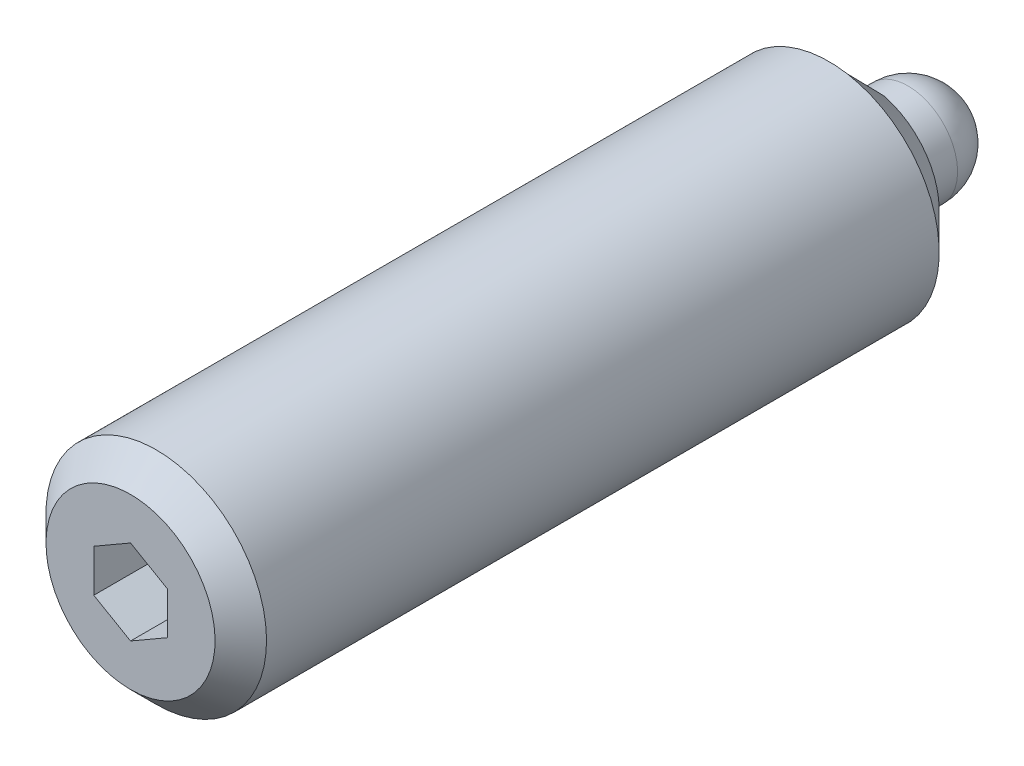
ISO-10303-21;
HEADER;
FILE_DESCRIPTION(('STEP AP214'),'2;1');
FILE_NAME('part.step','',(''),(''),'','','');
FILE_SCHEMA(('AUTOMOTIVE_DESIGN { 1 0 10303 214 1 1 1 1 }'));
ENDSEC;
DATA;
#1=APPLICATION_CONTEXT('core data for automotive mechanical design processes');
#2=APPLICATION_PROTOCOL_DEFINITION('international standard','automotive_design',2000,#1);
#3=PRODUCT_CONTEXT('',#1,'mechanical');
#4=PRODUCT('Part','Part','',(#3));
#5=PRODUCT_RELATED_PRODUCT_CATEGORY('part','',(#4));
#6=PRODUCT_DEFINITION_FORMATION('','',#4);
#7=PRODUCT_DEFINITION_CONTEXT('part definition',#1,'design');
#8=PRODUCT_DEFINITION('design','',#6,#7);
#9=PRODUCT_DEFINITION_SHAPE('','',#8);
#10=(LENGTH_UNIT() NAMED_UNIT(*) SI_UNIT(.MILLI.,.METRE.));
#11=(NAMED_UNIT(*) PLANE_ANGLE_UNIT() SI_UNIT($,.RADIAN.));
#12=(NAMED_UNIT(*) SI_UNIT($,.STERADIAN.) SOLID_ANGLE_UNIT());
#13=UNCERTAINTY_MEASURE_WITH_UNIT(LENGTH_MEASURE(1.E-05),#10,'distance_accuracy_value','');
#14=(GEOMETRIC_REPRESENTATION_CONTEXT(3) GLOBAL_UNCERTAINTY_ASSIGNED_CONTEXT((#13)) GLOBAL_UNIT_ASSIGNED_CONTEXT((#10,
#11,#12)) REPRESENTATION_CONTEXT('',''));
#15=CARTESIAN_POINT('',(0.,0.,0.));
#16=DIRECTION('',(0.,0.,1.));
#17=DIRECTION('',(1.,0.,0.));
#18=AXIS2_PLACEMENT_3D('',#15,#16,#17);
#19=CARTESIAN_POINT('',(0.,1.35,2.5));
#20=DIRECTION('',(0.,0.,-1.));
#21=DIRECTION('',(-1.,0.,0.));
#22=AXIS2_PLACEMENT_3D('',#19,#20,#21);
#23=PLANE('',#22);
#24=DIRECTION('',(0.,1.,0.));
#25=VECTOR('',#24,1.);
#26=CARTESIAN_POINT('',(-0.5,-1.25399362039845,2.5));
#27=LINE('',#26,#25);
#28=CARTESIAN_POINT('',(-0.5,-1.9364916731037,2.5));
#29=VERTEX_POINT('',#28);
#30=CARTESIAN_POINT('',(-0.5,-1.25399362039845,2.5));
#31=VERTEX_POINT('',#30);
#32=EDGE_CURVE('E136',#29,#31,#27,.T.);
#33=ORIENTED_EDGE('',*,*,#32,.F.);
#34=CARTESIAN_POINT('',(0.,0.,2.5));
#35=DIRECTION('',(0.,0.,-1.));
#36=DIRECTION('',(0.,1.,0.));
#37=AXIS2_PLACEMENT_3D('',#34,#35,#36);
#38=CIRCLE('',#37,2.);
#39=CARTESIAN_POINT('',(-0.5,1.9364916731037,2.5));
#40=VERTEX_POINT('',#39);
#41=EDGE_CURVE('E227',#29,#40,#38,.T.);
#42=ORIENTED_EDGE('',*,*,#41,.T.);
#43=DIRECTION('',(0.,1.,0.));
#44=VECTOR('',#43,1.);
#45=CARTESIAN_POINT('',(-0.5,3.47467274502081,2.5));
#46=LINE('',#45,#44);
#47=CARTESIAN_POINT('',(-0.5,1.25399362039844,2.5));
#48=VERTEX_POINT('',#47);
#49=EDGE_CURVE('E154',#48,#40,#46,.T.);
#50=ORIENTED_EDGE('',*,*,#49,.F.);
#51=CARTESIAN_POINT('',(0.,0.,2.5));
#52=DIRECTION('',(0.,0.,-1.));
#53=DIRECTION('',(-1.,0.,0.));
#54=AXIS2_PLACEMENT_3D('',#51,#52,#53);
#55=CIRCLE('',#54,1.35);
#56=EDGE_CURVE('E218',#31,#48,#55,.T.);
#57=ORIENTED_EDGE('',*,*,#56,.F.);
#58=EDGE_LOOP('',(#33,#42,#50,#57));
#59=FACE_BOUND('',#58,.T.);
#60=ADVANCED_FACE('F14',(#59),#23,.T.);
#61=CARTESIAN_POINT('',(0.,0.,2.5));
#62=DIRECTION('',(0.,0.,1.));
#63=DIRECTION('',(0.,-1.,0.));
#64=AXIS2_PLACEMENT_3D('',#61,#62,#63);
#65=CONICAL_SURFACE('',#64,2.,0.785398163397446);
#66=CARTESIAN_POINT('',(-0.5,-4.21027952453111,4.7398648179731));
#67=CARTESIAN_POINT('',(-0.5,-4.04912718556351,4.57985052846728));
#68=CARTESIAN_POINT('',(-0.500000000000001,-3.88792343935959,4.41988777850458));
#69=CARTESIAN_POINT('',(-0.500000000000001,-3.56534038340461,4.10016153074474));
#70=CARTESIAN_POINT('',(-0.5,-3.4039610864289,3.94039802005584));
#71=CARTESIAN_POINT('',(-0.5,-3.08097988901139,3.62119168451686));
#72=CARTESIAN_POINT('',(-0.5,-2.91937806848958,3.46174877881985));
#73=CARTESIAN_POINT('',(-0.5,-2.5957327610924,3.14328890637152));
#74=CARTESIAN_POINT('',(-0.5,-2.43368924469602,2.98427196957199));
#75=CARTESIAN_POINT('',(-0.5,-2.20373868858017,2.75970346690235));
#76=CARTESIAN_POINT('',(-0.5,-2.13614845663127,2.69382760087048));
#77=CARTESIAN_POINT('',(-0.5,-2.00079166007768,2.56225904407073));
#78=CARTESIAN_POINT('',(-0.5,-1.93302509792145,2.49656635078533));
#79=CARTESIAN_POINT('',(-0.5,-1.79726638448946,2.36543760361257));
#80=CARTESIAN_POINT('',(-0.5,-1.72927427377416,2.30000150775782));
#81=CARTESIAN_POINT('',(-0.5,-1.59295780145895,2.16946905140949));
#82=CARTESIAN_POINT('',(-0.5,-1.52463342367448,2.10437270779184));
#83=CARTESIAN_POINT('',(-0.5,-1.38747092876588,1.97464527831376));
#84=CARTESIAN_POINT('',(-0.5,-1.3186325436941,1.91001447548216));
#85=CARTESIAN_POINT('',(-0.5,-1.18024864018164,1.78152916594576));
#86=CARTESIAN_POINT('',(-0.5,-1.11070321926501,1.71767455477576));
#87=CARTESIAN_POINT('',(-0.5,-1.00548564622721,1.62284194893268));
#88=CARTESIAN_POINT('',(-0.5,-0.970251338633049,1.59137898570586));
#89=CARTESIAN_POINT('',(-0.5,-0.899394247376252,1.52889802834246));
#90=CARTESIAN_POINT('',(-0.5,-0.863771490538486,1.4978800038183));
#91=CARTESIAN_POINT('',(-0.5,-0.791991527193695,1.43642895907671));
#92=CARTESIAN_POINT('',(-0.5,-0.755834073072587,1.40599622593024));
#93=CARTESIAN_POINT('',(-0.5,-0.682771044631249,1.34602680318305));
#94=CARTESIAN_POINT('',(-0.5,-0.645865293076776,1.31649033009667));
#95=CARTESIAN_POINT('',(-0.5,-0.608478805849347,1.28755727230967));
#96=B_SPLINE_CURVE_WITH_KNOTS('',3,(#66,#67,#68,#69,#70,#71,#72,#73,#74,#75,#76,#77,#78,#79,#80,
#81,#82,#83,#84,#85,#86,#87,#88,#89,#90,#91,#92,#93,#94,#95),.UNSPECIFIED.,.F.,.F.,(4,2,2,2,2,2,
2,2,2,2,2,2,2,2,4),(0.,0.681301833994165,1.36255702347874,2.04361079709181,2.72471126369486,
3.00785872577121,3.29100227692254,3.57409740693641,3.85720646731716,4.14047515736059,
4.42370529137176,4.56541471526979,4.70711441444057,4.84888192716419,4.99068341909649),.UNSPECIFIED.);
#97=CARTESIAN_POINT('',(-0.5,-2.9580398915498,3.5));
#98=VERTEX_POINT('',#97);
#99=EDGE_CURVE('E9',#98,#29,#96,.T.);
#100=ORIENTED_EDGE('',*,*,#99,.F.);
#101=CARTESIAN_POINT('',(0.,0.,3.5));
#102=DIRECTION('',(0.,0.,-1.));
#103=DIRECTION('',(0.,1.,0.));
#104=AXIS2_PLACEMENT_3D('',#101,#102,#103);
#105=CIRCLE('',#104,3.);
#106=CARTESIAN_POINT('',(-0.5,2.9580398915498,3.5));
#107=VERTEX_POINT('',#106);
#108=EDGE_CURVE('E232',#107,#98,#105,.F.);
#109=ORIENTED_EDGE('',*,*,#108,.F.);
#110=CARTESIAN_POINT('',(-0.5,0.794414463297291,1.43866625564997));
#111=CARTESIAN_POINT('',(-0.5,0.829426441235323,1.46831353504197));
#112=CARTESIAN_POINT('',(-0.5,0.864178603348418,1.49826325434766));
#113=CARTESIAN_POINT('',(-0.5,0.933269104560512,1.5586320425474));
#114=CARTESIAN_POINT('',(-0.5,0.967607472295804,1.58905107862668));
#115=CARTESIAN_POINT('',(-0.5,1.07015688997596,1.68080538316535));
#116=CARTESIAN_POINT('',(-0.5,1.13791337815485,1.74264741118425));
#117=CARTESIAN_POINT('',(-0.5,1.27266367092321,1.86711918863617));
#118=CARTESIAN_POINT('',(-0.5,1.33965766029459,1.92974873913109));
#119=CARTESIAN_POINT('',(-0.5,1.47315463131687,2.05553399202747));
#120=CARTESIAN_POINT('',(-0.5,1.53965759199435,2.11868971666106));
#121=CARTESIAN_POINT('',(-0.5,1.6798220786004,2.2525184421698));
#122=CARTESIAN_POINT('',(-0.5,1.75344286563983,2.32323404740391));
#123=CARTESIAN_POINT('',(-0.5,1.9003952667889,2.46497569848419));
#124=CARTESIAN_POINT('',(-0.5,1.97372685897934,2.53600176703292));
#125=CARTESIAN_POINT('',(-0.5,2.19454222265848,2.75050496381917));
#126=CARTESIAN_POINT('',(-0.5,2.34170559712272,2.89431173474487));
#127=CARTESIAN_POINT('',(-0.5,2.63555520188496,3.18241211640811));
#128=CARTESIAN_POINT('',(-0.5,2.78224143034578,3.32670572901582));
#129=CARTESIAN_POINT('',(-0.5,3.07526769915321,3.61555084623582));
#130=CARTESIAN_POINT('',(-0.5,3.22160783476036,3.76010225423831));
#131=CARTESIAN_POINT('',(-0.5,3.51407993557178,4.04941239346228));
#132=CARTESIAN_POINT('',(-0.5,3.66021190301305,4.19417112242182));
#133=CARTESIAN_POINT('',(-0.5,3.80628698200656,4.33898692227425));
#134=B_SPLINE_CURVE_WITH_KNOTS('',3,(#110,#111,#112,#113,#114,#115,#116,#117,#118,#119,#120,
#121,#122,#123,#124,#125,#126,#127,#128,#129,#130,#131,#132,#133),.UNSPECIFIED.,.F.,.F.,(4,2,2,
2,2,2,2,2,2,2,2,4),(0.,0.137628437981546,0.275247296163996,0.550441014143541,0.825566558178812,
1.100703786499,1.40694830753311,1.71321561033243,2.3304950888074,2.94777694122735,
3.5648624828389,4.18194134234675),.UNSPECIFIED.);
#135=EDGE_CURVE('E235',#40,#107,#134,.T.);
#136=ORIENTED_EDGE('',*,*,#135,.F.);
#137=ORIENTED_EDGE('',*,*,#41,.F.);
#138=EDGE_LOOP('',(#100,#109,#136,#137));
#139=FACE_BOUND('',#138,.T.);
#140=ADVANCED_FACE('F303',(#139),#65,.T.);
#141=CARTESIAN_POINT('',(0.,3.,22.5));
#142=DIRECTION('',(0.,0.,1.));
#143=DIRECTION('',(1.,0.,0.));
#144=AXIS2_PLACEMENT_3D('',#141,#142,#143);
#145=PLANE('',#144);
#146=CARTESIAN_POINT('',(0.,0.,22.5));
#147=DIRECTION('',(0.,0.,1.));
#148=DIRECTION('',(0.,-1.,0.));
#149=AXIS2_PLACEMENT_3D('',#146,#147,#148);
#150=CIRCLE('',#149,2.3);
#151=CARTESIAN_POINT('',(0.,-2.30000000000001,22.5));
#152=VERTEX_POINT('',#151);
#153=EDGE_CURVE('E224',#152,#152,#150,.T.);
#154=ORIENTED_EDGE('',*,*,#153,.T.);
#155=EDGE_LOOP('',(#154));
#156=FACE_BOUND('',#155,.T.);
#157=DIRECTION('',(0.866025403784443,-0.499999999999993,0.));
#158=VECTOR('',#157,1.);
#159=CARTESIAN_POINT('',(-1.,-0.577350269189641,22.5));
#160=LINE('',#159,#158);
#161=CARTESIAN_POINT('',(-1.,-0.57735026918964,22.5));
#162=VERTEX_POINT('',#161);
#163=CARTESIAN_POINT('',(0.,-1.15470053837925,22.5));
#164=VERTEX_POINT('',#163);
#165=EDGE_CURVE('E181',#162,#164,#160,.T.);
#166=ORIENTED_EDGE('',*,*,#165,.F.);
#167=DIRECTION('',(0.,1.,0.));
#168=VECTOR('',#167,1.);
#169=CARTESIAN_POINT('',(-1.,-0.577350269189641,22.5));
#170=LINE('',#169,#168);
#171=CARTESIAN_POINT('',(-1.,0.577350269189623,22.5));
#172=VERTEX_POINT('',#171);
#173=EDGE_CURVE('E164',#162,#172,#170,.T.);
#174=ORIENTED_EDGE('',*,*,#173,.T.);
#175=DIRECTION('',(0.866025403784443,0.499999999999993,0.));
#176=VECTOR('',#175,1.);
#177=CARTESIAN_POINT('',(-1.,0.577350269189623,22.5));
#178=LINE('',#177,#176);
#179=CARTESIAN_POINT('',(0.,1.15470053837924,22.5));
#180=VERTEX_POINT('',#179);
#181=EDGE_CURVE('E169',#172,#180,#178,.T.);
#182=ORIENTED_EDGE('',*,*,#181,.T.);
#183=DIRECTION('',(-0.866025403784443,0.499999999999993,0.));
#184=VECTOR('',#183,1.);
#185=CARTESIAN_POINT('',(1.,0.577350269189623,22.5));
#186=LINE('',#185,#184);
#187=CARTESIAN_POINT('',(1.,0.577350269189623,22.5));
#188=VERTEX_POINT('',#187);
#189=EDGE_CURVE('E172',#188,#180,#186,.T.);
#190=ORIENTED_EDGE('',*,*,#189,.F.);
#191=DIRECTION('',(0.,1.,0.));
#192=VECTOR('',#191,1.);
#193=CARTESIAN_POINT('',(1.,-0.577350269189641,22.5));
#194=LINE('',#193,#192);
#195=CARTESIAN_POINT('',(1.,-0.577350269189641,22.5));
#196=VERTEX_POINT('',#195);
#197=EDGE_CURVE('E175',#196,#188,#194,.T.);
#198=ORIENTED_EDGE('',*,*,#197,.F.);
#199=DIRECTION('',(-0.866025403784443,-0.499999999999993,0.));
#200=VECTOR('',#199,1.);
#201=CARTESIAN_POINT('',(1.,-0.577350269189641,22.5));
#202=LINE('',#201,#200);
#203=EDGE_CURVE('E178',#196,#164,#202,.T.);
#204=ORIENTED_EDGE('',*,*,#203,.T.);
#205=EDGE_LOOP('',(#166,#174,#182,#190,#198,#204));
#206=FACE_BOUND('',#205,.T.);
#207=ADVANCED_FACE('F300',(#156,#206),#145,.T.);
#208=CARTESIAN_POINT('',(0.,0.,1.35));
#209=DIRECTION('',(-1.,0.,0.));
#210=DIRECTION('',(0.,0.,1.));
#211=AXIS2_PLACEMENT_3D('',#208,#209,#210);
#212=SPHERICAL_SURFACE('',#211,1.35);
#213=CARTESIAN_POINT('',(0.,0.,1.35));
#214=DIRECTION('',(0.,0.,-1.));
#215=DIRECTION('',(-1.,0.,0.));
#216=AXIS2_PLACEMENT_3D('',#213,#214,#215);
#217=SPHERICAL_SURFACE('',#216,1.35);
#218=CARTESIAN_POINT('',(0.,0.,1.35));
#219=DIRECTION('',(0.,0.,-1.));
#220=DIRECTION('',(-1.,0.,0.));
#221=AXIS2_PLACEMENT_3D('',#218,#219,#220);
#222=CIRCLE('',#221,1.35);
#223=CARTESIAN_POINT('',(-1.35,0.,1.35));
#224=VERTEX_POINT('',#223);
#225=EDGE_CURVE('E215',#224,#224,#222,.T.);
#226=ORIENTED_EDGE('',*,*,#225,.T.);
#227=EDGE_LOOP('',(#226));
#228=FACE_BOUND('',#227,.T.);
#229=ADVANCED_FACE('F298',(#228),#217,.T.);
#230=CARTESIAN_POINT('',(0.,0.,-3.5));
#231=DIRECTION('',(0.,0.,-1.));
#232=DIRECTION('',(-1.,0.,0.));
#233=AXIS2_PLACEMENT_3D('',#230,#231,#232);
#234=CYLINDRICAL_SURFACE('',#233,3.);
#235=ORIENTED_EDGE('',*,*,#108,.T.);
#236=CARTESIAN_POINT('',(0.5,-2.95803989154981,3.5));
#237=VERTEX_POINT('',#236);
#238=EDGE_CURVE('E127',#98,#237,#105,.F.);
#239=ORIENTED_EDGE('',*,*,#238,.T.);
#240=CARTESIAN_POINT('',(0.5,2.95803989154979,3.5));
#241=VERTEX_POINT('',#240);
#242=EDGE_CURVE('E236',#237,#241,#105,.F.);
#243=ORIENTED_EDGE('',*,*,#242,.T.);
#244=EDGE_CURVE('E231',#241,#107,#105,.F.);
#245=ORIENTED_EDGE('',*,*,#244,.T.);
#246=EDGE_LOOP('',(#235,#239,#243,#245));
#247=FACE_BOUND('',#246,.T.);
#248=CARTESIAN_POINT('',(0.,0.,21.8));
#249=DIRECTION('',(0.,0.,1.));
#250=DIRECTION('',(0.,-1.,0.));
#251=AXIS2_PLACEMENT_3D('',#248,#249,#250);
#252=CIRCLE('',#251,3.);
#253=CARTESIAN_POINT('',(0.,-3.00000000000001,21.8));
#254=VERTEX_POINT('',#253);
#255=EDGE_CURVE('E221',#254,#254,#252,.F.);
#256=ORIENTED_EDGE('',*,*,#255,.T.);
#257=EDGE_LOOP('',(#256));
#258=FACE_BOUND('',#257,.T.);
#259=ADVANCED_FACE('F294',(#247,#258),#234,.T.);
#260=DIRECTION('',(0.,-1.,0.));
#261=VECTOR('',#260,1.);
#262=CARTESIAN_POINT('',(0.5,-1.25399362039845,2.5));
#263=LINE('',#262,#261);
#264=CARTESIAN_POINT('',(0.5,-1.25399362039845,2.5));
#265=VERTEX_POINT('',#264);
#266=CARTESIAN_POINT('',(0.5,-1.9364916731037,2.5));
#267=VERTEX_POINT('',#266);
#268=EDGE_CURVE('E130',#265,#267,#263,.T.);
#269=ORIENTED_EDGE('',*,*,#268,.F.);
#270=CARTESIAN_POINT('',(0.5,1.25399362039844,2.5));
#271=VERTEX_POINT('',#270);
#272=EDGE_CURVE('E219',#271,#265,#55,.T.);
#273=ORIENTED_EDGE('',*,*,#272,.F.);
#274=DIRECTION('',(0.,-1.,0.));
#275=VECTOR('',#274,1.);
#276=CARTESIAN_POINT('',(0.5,3.47467274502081,2.5));
#277=LINE('',#276,#275);
#278=CARTESIAN_POINT('',(0.5,1.9364916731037,2.5));
#279=VERTEX_POINT('',#278);
#280=EDGE_CURVE('E149',#279,#271,#277,.T.);
#281=ORIENTED_EDGE('',*,*,#280,.F.);
#282=EDGE_CURVE('E228',#279,#267,#38,.T.);
#283=ORIENTED_EDGE('',*,*,#282,.T.);
#284=EDGE_LOOP('',(#269,#273,#281,#283));
#285=FACE_BOUND('',#284,.T.);
#286=ADVANCED_FACE('F291',(#285),#23,.T.);
#287=CARTESIAN_POINT('',(0.,0.,-3.5));
#288=DIRECTION('',(0.,0.,-1.));
#289=DIRECTION('',(-1.,0.,0.));
#290=AXIS2_PLACEMENT_3D('',#287,#288,#289);
#291=CYLINDRICAL_SURFACE('',#290,1.35);
#292=ORIENTED_EDGE('',*,*,#272,.T.);
#293=DIRECTION('',(0.,0.,-1.));
#294=VECTOR('',#293,1.);
#295=CARTESIAN_POINT('',(0.5,-1.25399362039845,3.5));
#296=LINE('',#295,#294);
#297=CARTESIAN_POINT('',(0.5,-1.25399362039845,3.5));
#298=VERTEX_POINT('',#297);
#299=EDGE_CURVE('E139',#298,#265,#296,.T.);
#300=ORIENTED_EDGE('',*,*,#299,.F.);
#301=CARTESIAN_POINT('',(0.,0.,3.5));
#302=DIRECTION('',(0.,0.,1.));
#303=DIRECTION('',(0.,1.,0.));
#304=AXIS2_PLACEMENT_3D('',#301,#302,#303);
#305=CIRCLE('',#304,1.35);
#306=CARTESIAN_POINT('',(-0.5,-1.25399362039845,3.5));
#307=VERTEX_POINT('',#306);
#308=EDGE_CURVE('E125',#307,#298,#305,.T.);
#309=ORIENTED_EDGE('',*,*,#308,.F.);
#310=DIRECTION('',(0.,0.,-1.));
#311=VECTOR('',#310,1.);
#312=CARTESIAN_POINT('',(-0.5,-1.25399362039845,3.5));
#313=LINE('',#312,#311);
#314=EDGE_CURVE('E133',#307,#31,#313,.T.);
#315=ORIENTED_EDGE('',*,*,#314,.T.);
#316=ORIENTED_EDGE('',*,*,#56,.T.);
#317=DIRECTION('',(0.,0.,-1.));
#318=VECTOR('',#317,1.);
#319=CARTESIAN_POINT('',(-0.5,1.25399362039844,3.5));
#320=LINE('',#319,#318);
#321=CARTESIAN_POINT('',(-0.5,1.25399362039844,3.5));
#322=VERTEX_POINT('',#321);
#323=EDGE_CURVE('E161',#322,#48,#320,.T.);
#324=ORIENTED_EDGE('',*,*,#323,.F.);
#325=CARTESIAN_POINT('',(0.,0.,3.5));
#326=DIRECTION('',(0.,0.,1.));
#327=DIRECTION('',(0.,1.,0.));
#328=AXIS2_PLACEMENT_3D('',#325,#326,#327);
#329=CIRCLE('',#328,1.35);
#330=CARTESIAN_POINT('',(0.5,1.25399362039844,3.5));
#331=VERTEX_POINT('',#330);
#332=EDGE_CURVE('E153',#331,#322,#329,.T.);
#333=ORIENTED_EDGE('',*,*,#332,.F.);
#334=DIRECTION('',(0.,0.,-1.));
#335=VECTOR('',#334,1.);
#336=CARTESIAN_POINT('',(0.5,1.25399362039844,3.5));
#337=LINE('',#336,#335);
#338=EDGE_CURVE('E157',#331,#271,#337,.T.);
#339=ORIENTED_EDGE('',*,*,#338,.T.);
#340=EDGE_LOOP('',(#292,#300,#309,#315,#316,#324,#333,#339));
#341=FACE_BOUND('',#340,.T.);
#342=ORIENTED_EDGE('',*,*,#225,.F.);
#343=EDGE_LOOP('',(#342));
#344=FACE_BOUND('',#343,.T.);
#345=ADVANCED_FACE('F142',(#341,#344),#291,.T.);
#346=CARTESIAN_POINT('',(-1.,-0.57735026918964,20.));
#347=DIRECTION('',(1.,0.,0.));
#348=DIRECTION('',(0.,0.,-1.));
#349=AXIS2_PLACEMENT_3D('',#346,#347,#348);
#350=PLANE('',#349);
#351=DIRECTION('',(0.,0.,1.));
#352=VECTOR('',#351,1.);
#353=CARTESIAN_POINT('',(-1.,0.577350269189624,20.));
#354=LINE('',#353,#352);
#355=CARTESIAN_POINT('',(-1.,0.577350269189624,20.));
#356=VERTEX_POINT('',#355);
#357=EDGE_CURVE('E213',#356,#172,#354,.T.);
#358=ORIENTED_EDGE('',*,*,#357,.T.);
#359=ORIENTED_EDGE('',*,*,#173,.F.);
#360=DIRECTION('',(0.,0.,1.));
#361=VECTOR('',#360,1.);
#362=CARTESIAN_POINT('',(-1.,-0.57735026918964,20.));
#363=LINE('',#362,#361);
#364=CARTESIAN_POINT('',(-1.,-0.57735026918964,20.));
#365=VERTEX_POINT('',#364);
#366=EDGE_CURVE('E202',#365,#162,#363,.T.);
#367=ORIENTED_EDGE('',*,*,#366,.F.);
#368=DIRECTION('',(0.,1.,0.));
#369=VECTOR('',#368,1.);
#370=CARTESIAN_POINT('',(-1.,-0.57735026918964,20.));
#371=LINE('',#370,#369);
#372=EDGE_CURVE('E184',#365,#356,#371,.T.);
#373=ORIENTED_EDGE('',*,*,#372,.T.);
#374=EDGE_LOOP('',(#358,#359,#367,#373));
#375=FACE_BOUND('',#374,.T.);
#376=ADVANCED_FACE('F267',(#375),#350,.T.);
#377=CARTESIAN_POINT('',(-1.,0.577350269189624,20.));
#378=DIRECTION('',(0.499999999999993,-0.866025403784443,0.));
#379=DIRECTION('',(0.866025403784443,0.499999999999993,0.));
#380=AXIS2_PLACEMENT_3D('',#377,#378,#379);
#381=PLANE('',#380);
#382=DIRECTION('',(0.,0.,1.));
#383=VECTOR('',#382,1.);
#384=CARTESIAN_POINT('',(0.,1.15470053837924,20.));
#385=LINE('',#384,#383);
#386=CARTESIAN_POINT('',(0.,1.15470053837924,20.));
#387=VERTEX_POINT('',#386);
#388=EDGE_CURVE('E211',#387,#180,#385,.T.);
#389=ORIENTED_EDGE('',*,*,#388,.T.);
#390=ORIENTED_EDGE('',*,*,#181,.F.);
#391=ORIENTED_EDGE('',*,*,#357,.F.);
#392=DIRECTION('',(0.866025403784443,0.499999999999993,0.));
#393=VECTOR('',#392,1.);
#394=CARTESIAN_POINT('',(-1.,0.577350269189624,20.));
#395=LINE('',#394,#393);
#396=EDGE_CURVE('E187',#356,#387,#395,.T.);
#397=ORIENTED_EDGE('',*,*,#396,.T.);
#398=EDGE_LOOP('',(#389,#390,#391,#397));
#399=FACE_BOUND('',#398,.T.);
#400=ADVANCED_FACE('F270',(#399),#381,.T.);
#401=CARTESIAN_POINT('',(1.,0.577350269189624,20.));
#402=DIRECTION('',(0.499999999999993,0.866025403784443,0.));
#403=DIRECTION('',(-0.866025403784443,0.499999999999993,0.));
#404=AXIS2_PLACEMENT_3D('',#401,#402,#403);
#405=PLANE('',#404);
#406=DIRECTION('',(0.,0.,1.));
#407=VECTOR('',#406,1.);
#408=CARTESIAN_POINT('',(1.,0.577350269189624,20.));
#409=LINE('',#408,#407);
#410=CARTESIAN_POINT('',(1.,0.577350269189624,20.));
#411=VERTEX_POINT('',#410);
#412=EDGE_CURVE('E209',#411,#188,#409,.T.);
#413=ORIENTED_EDGE('',*,*,#412,.T.);
#414=ORIENTED_EDGE('',*,*,#189,.T.);
#415=ORIENTED_EDGE('',*,*,#388,.F.);
#416=DIRECTION('',(-0.866025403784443,0.499999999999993,0.));
#417=VECTOR('',#416,1.);
#418=CARTESIAN_POINT('',(1.,0.577350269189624,20.));
#419=LINE('',#418,#417);
#420=EDGE_CURVE('E190',#411,#387,#419,.T.);
#421=ORIENTED_EDGE('',*,*,#420,.F.);
#422=EDGE_LOOP('',(#413,#414,#415,#421));
#423=FACE_BOUND('',#422,.T.);
#424=ADVANCED_FACE('F281',(#423),#405,.F.);
#425=CARTESIAN_POINT('',(1.,-0.57735026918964,20.));
#426=DIRECTION('',(1.,0.,0.));
#427=DIRECTION('',(0.,0.,-1.));
#428=AXIS2_PLACEMENT_3D('',#425,#426,#427);
#429=PLANE('',#428);
#430=DIRECTION('',(0.,0.,1.));
#431=VECTOR('',#430,1.);
#432=CARTESIAN_POINT('',(1.,-0.57735026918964,20.));
#433=LINE('',#432,#431);
#434=CARTESIAN_POINT('',(1.,-0.57735026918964,20.));
#435=VERTEX_POINT('',#434);
#436=EDGE_CURVE('E207',#435,#196,#433,.T.);
#437=ORIENTED_EDGE('',*,*,#436,.T.);
#438=ORIENTED_EDGE('',*,*,#197,.T.);
#439=ORIENTED_EDGE('',*,*,#412,.F.);
#440=DIRECTION('',(0.,1.,0.));
#441=VECTOR('',#440,1.);
#442=CARTESIAN_POINT('',(1.,-0.57735026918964,20.));
#443=LINE('',#442,#441);
#444=EDGE_CURVE('E193',#435,#411,#443,.T.);
#445=ORIENTED_EDGE('',*,*,#444,.F.);
#446=EDGE_LOOP('',(#437,#438,#439,#445));
#447=FACE_BOUND('',#446,.T.);
#448=ADVANCED_FACE('F277',(#447),#429,.F.);
#449=CARTESIAN_POINT('',(1.,-0.57735026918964,20.));
#450=DIRECTION('',(-0.499999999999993,0.866025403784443,0.));
#451=DIRECTION('',(-0.866025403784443,-0.499999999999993,0.));
#452=AXIS2_PLACEMENT_3D('',#449,#450,#451);
#453=PLANE('',#452);
#454=DIRECTION('',(0.,0.,1.));
#455=VECTOR('',#454,1.);
#456=CARTESIAN_POINT('',(0.,-1.15470053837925,20.));
#457=LINE('',#456,#455);
#458=CARTESIAN_POINT('',(0.,-1.15470053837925,20.));
#459=VERTEX_POINT('',#458);
#460=EDGE_CURVE('E205',#459,#164,#457,.T.);
#461=ORIENTED_EDGE('',*,*,#460,.T.);
#462=ORIENTED_EDGE('',*,*,#203,.F.);
#463=ORIENTED_EDGE('',*,*,#436,.F.);
#464=DIRECTION('',(-0.866025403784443,-0.499999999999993,0.));
#465=VECTOR('',#464,1.);
#466=CARTESIAN_POINT('',(1.,-0.57735026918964,20.));
#467=LINE('',#466,#465);
#468=EDGE_CURVE('E196',#435,#459,#467,.T.);
#469=ORIENTED_EDGE('',*,*,#468,.T.);
#470=EDGE_LOOP('',(#461,#462,#463,#469));
#471=FACE_BOUND('',#470,.T.);
#472=ADVANCED_FACE('F266',(#471),#453,.T.);
#473=CARTESIAN_POINT('',(-1.,-0.57735026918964,20.));
#474=DIRECTION('',(-0.499999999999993,-0.866025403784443,0.));
#475=DIRECTION('',(0.866025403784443,-0.499999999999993,0.));
#476=AXIS2_PLACEMENT_3D('',#473,#474,#475);
#477=PLANE('',#476);
#478=DIRECTION('',(0.866025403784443,-0.499999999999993,0.));
#479=VECTOR('',#478,1.);
#480=CARTESIAN_POINT('',(-1.,-0.57735026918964,20.));
#481=LINE('',#480,#479);
#482=EDGE_CURVE('E199',#365,#459,#481,.T.);
#483=ORIENTED_EDGE('',*,*,#482,.F.);
#484=ORIENTED_EDGE('',*,*,#366,.T.);
#485=ORIENTED_EDGE('',*,*,#165,.T.);
#486=ORIENTED_EDGE('',*,*,#460,.F.);
#487=EDGE_LOOP('',(#483,#484,#485,#486));
#488=FACE_BOUND('',#487,.T.);
#489=ADVANCED_FACE('F264',(#488),#477,.F.);
#490=CARTESIAN_POINT('',(-1.,0.577350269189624,20.));
#491=DIRECTION('',(0.,0.,-1.));
#492=DIRECTION('',(-1.,0.,0.));
#493=AXIS2_PLACEMENT_3D('',#490,#491,#492);
#494=PLANE('',#493);
#495=ORIENTED_EDGE('',*,*,#372,.F.);
#496=ORIENTED_EDGE('',*,*,#482,.T.);
#497=ORIENTED_EDGE('',*,*,#468,.F.);
#498=ORIENTED_EDGE('',*,*,#444,.T.);
#499=ORIENTED_EDGE('',*,*,#420,.T.);
#500=ORIENTED_EDGE('',*,*,#396,.F.);
#501=EDGE_LOOP('',(#495,#496,#497,#498,#499,#500));
#502=FACE_BOUND('',#501,.T.);
#503=ADVANCED_FACE('F260',(#502),#494,.F.);
#504=CARTESIAN_POINT('',(0.,0.,21.8));
#505=DIRECTION('',(0.,0.,-1.));
#506=DIRECTION('',(0.,1.,0.));
#507=AXIS2_PLACEMENT_3D('',#504,#505,#506);
#508=CONICAL_SURFACE('',#507,3.,0.78539816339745);
#509=ORIENTED_EDGE('',*,*,#153,.F.);
#510=EDGE_LOOP('',(#509));
#511=FACE_BOUND('',#510,.T.);
#512=ORIENTED_EDGE('',*,*,#255,.F.);
#513=EDGE_LOOP('',(#512));
#514=FACE_BOUND('',#513,.T.);
#515=ADVANCED_FACE('F263',(#511,#514),#508,.T.);
#516=CARTESIAN_POINT('',(0.5,-0.608478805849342,1.28755727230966));
#517=CARTESIAN_POINT('',(0.5,-0.638982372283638,1.31114809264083));
#518=CARTESIAN_POINT('',(0.5,-0.669158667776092,1.33515279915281));
#519=CARTESIAN_POINT('',(0.5,-0.728984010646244,1.3838012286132));
#520=CARTESIAN_POINT('',(0.5,-0.758633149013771,1.40844483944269));
#521=CARTESIAN_POINT('',(0.5,-0.817529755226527,1.45818032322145));
#522=CARTESIAN_POINT('',(0.5,-0.846777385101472,1.48327200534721));
#523=CARTESIAN_POINT('',(0.5,-0.904968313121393,1.53380830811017));
#524=CARTESIAN_POINT('',(0.5,-0.933911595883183,1.55925294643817));
#525=CARTESIAN_POINT('',(0.5,-1.02034660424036,1.63595639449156));
#526=CARTESIAN_POINT('',(0.5,-1.07748131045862,1.68761706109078));
#527=CARTESIAN_POINT('',(0.5,-1.19113581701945,1.79162146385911));
#528=CARTESIAN_POINT('',(0.5,-1.24765553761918,1.84396528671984));
#529=CARTESIAN_POINT('',(0.5,-1.38564375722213,1.9728020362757));
#530=CARTESIAN_POINT('',(0.5,-1.4668766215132,2.04954707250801));
#531=CARTESIAN_POINT('',(0.5,-1.62877991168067,2.20361898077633));
#532=CARTESIAN_POINT('',(0.5,-1.70945036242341,2.28094582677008));
#533=CARTESIAN_POINT('',(0.5,-1.950986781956,2.51356274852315));
#534=CARTESIAN_POINT('',(0.5,-2.11130534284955,2.66942071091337));
#535=CARTESIAN_POINT('',(0.5,-2.43378431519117,2.98437785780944));
#536=CARTESIAN_POINT('',(0.5,-2.59593305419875,3.14348894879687));
#537=CARTESIAN_POINT('',(0.5,-2.9197935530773,3.46215463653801));
#538=CARTESIAN_POINT('',(0.5,-3.08150531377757,3.62170923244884));
#539=CARTESIAN_POINT('',(0.5,-3.40449596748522,3.94092839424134));
#540=CARTESIAN_POINT('',(0.5,-3.56577513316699,4.10059268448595));
#541=CARTESIAN_POINT('',(0.5,-3.88814672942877,4.42010882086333));
#542=CARTESIAN_POINT('',(0.5,-4.04923916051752,4.57996066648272));
#543=CARTESIAN_POINT('',(0.5,-4.21027952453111,4.7398648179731));
#544=B_SPLINE_CURVE_WITH_KNOTS('',3,(#516,#517,#518,#519,#520,#521,#522,#523,#524,#525,#526,
#527,#528,#529,#530,#531,#532,#533,#534,#535,#536,#537,#538,#539,#540,#541,#542,#543),
.UNSPECIFIED.,.F.,.F.,(4,2,2,2,2,2,2,2,2,2,2,2,2,4),(0.,0.115672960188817,0.231325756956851,
0.346930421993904,0.46254090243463,0.693612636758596,0.924713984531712,1.25996533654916,
1.59520177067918,2.26597379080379,2.94749863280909,3.62902218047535,4.30985454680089,
4.99068505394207),.UNSPECIFIED.);
#545=EDGE_CURVE('E28',#267,#237,#544,.T.);
#546=ORIENTED_EDGE('',*,*,#545,.F.);
#547=ORIENTED_EDGE('',*,*,#282,.F.);
#548=CARTESIAN_POINT('',(0.5,3.80628698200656,4.33898692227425));
#549=CARTESIAN_POINT('',(0.5,3.66017177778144,4.19413132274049));
#550=CARTESIAN_POINT('',(0.5,3.51399963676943,4.04933284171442));
#551=CARTESIAN_POINT('',(0.5,3.22144830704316,3.75994457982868));
#552=CARTESIAN_POINT('',(0.5,3.07506911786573,3.61535479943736));
#553=CARTESIAN_POINT('',(0.5,2.78204568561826,3.32651307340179));
#554=CARTESIAN_POINT('',(0.5,2.63540151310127,3.18226105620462));
#555=CARTESIAN_POINT('',(0.5,2.34163097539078,2.89423895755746));
#556=CARTESIAN_POINT('',(0.5,2.19450459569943,2.75046889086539));
#557=CARTESIAN_POINT('',(0.5,1.94456304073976,2.50767128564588));
#558=CARTESIAN_POINT('',(0.5,1.84196789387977,2.40841735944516));
#559=CARTESIAN_POINT('',(0.499999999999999,1.63613587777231,2.21058883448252));
#560=CARTESIAN_POINT('',(0.499999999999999,1.53289905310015,2.11201418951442));
#561=CARTESIAN_POINT('',(0.499999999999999,1.37718050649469,1.96503885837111));
#562=CARTESIAN_POINT('',(0.499999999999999,1.32512364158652,1.91618858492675));
#563=CARTESIAN_POINT('',(0.499999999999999,1.22061594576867,1.81891471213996));
#564=CARTESIAN_POINT('',(0.499999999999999,1.16816512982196,1.77049109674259));
#565=CARTESIAN_POINT('',(0.499999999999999,1.0626920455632,1.67424278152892));
#566=CARTESIAN_POINT('',(0.499999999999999,1.00966964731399,1.6264182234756));
#567=CARTESIAN_POINT('',(0.499999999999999,0.929507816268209,1.55538250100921));
#568=CARTESIAN_POINT('',(0.499999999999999,0.902680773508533,1.53181930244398));
#569=CARTESIAN_POINT('',(0.499999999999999,0.848760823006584,1.4849969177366));
#570=CARTESIAN_POINT('',(0.5,0.821667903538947,1.46173774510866));
#571=CARTESIAN_POINT('',(0.5,0.79441446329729,1.43866625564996));
#572=B_SPLINE_CURVE_WITH_KNOTS('',3,(#548,#549,#550,#551,#552,#553,#554,#555,#556,#557,#558,
#559,#560,#561,#562,#563,#564,#565,#566,#567,#568,#569,#570,#571),.UNSPECIFIED.,.F.,.F.,(4,2,2,
2,2,2,2,2,2,2,2,4),(0.,0.617248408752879,1.23449820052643,1.8516026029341,2.46872573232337,
2.89696963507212,3.32518411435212,3.53934683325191,3.75350145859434,3.96770583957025,
4.07482166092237,4.18194222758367),.UNSPECIFIED.);
#573=EDGE_CURVE('E243',#241,#279,#572,.T.);
#574=ORIENTED_EDGE('',*,*,#573,.F.);
#575=ORIENTED_EDGE('',*,*,#242,.F.);
#576=EDGE_LOOP('',(#546,#547,#574,#575));
#577=FACE_BOUND('',#576,.T.);
#578=ADVANCED_FACE('F16',(#577),#65,.T.);
#579=CARTESIAN_POINT('',(0.5,3.47467274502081,3.5));
#580=DIRECTION('',(1.,0.,0.));
#581=DIRECTION('',(0.,1.,0.));
#582=AXIS2_PLACEMENT_3D('',#579,#580,#581);
#583=PLANE('',#582);
#584=ORIENTED_EDGE('',*,*,#573,.T.);
#585=ORIENTED_EDGE('',*,*,#280,.T.);
#586=ORIENTED_EDGE('',*,*,#338,.F.);
#587=DIRECTION('',(0.,-1.,0.));
#588=VECTOR('',#587,1.);
#589=CARTESIAN_POINT('',(0.5,3.47467274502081,3.5));
#590=LINE('',#589,#588);
#591=EDGE_CURVE('E151',#241,#331,#590,.T.);
#592=ORIENTED_EDGE('',*,*,#591,.F.);
#593=EDGE_LOOP('',(#584,#585,#586,#592));
#594=FACE_BOUND('',#593,.T.);
#595=ADVANCED_FACE('F254',(#594),#583,.F.);
#596=CARTESIAN_POINT('',(-0.5,3.47467274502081,3.5));
#597=DIRECTION('',(-1.,0.,0.));
#598=DIRECTION('',(0.,-1.,0.));
#599=AXIS2_PLACEMENT_3D('',#596,#597,#598);
#600=PLANE('',#599);
#601=ORIENTED_EDGE('',*,*,#135,.T.);
#602=DIRECTION('',(0.,1.,0.));
#603=VECTOR('',#602,1.);
#604=CARTESIAN_POINT('',(-0.5,3.47467274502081,3.5));
#605=LINE('',#604,#603);
#606=EDGE_CURVE('E43',#322,#107,#605,.T.);
#607=ORIENTED_EDGE('',*,*,#606,.F.);
#608=ORIENTED_EDGE('',*,*,#323,.T.);
#609=ORIENTED_EDGE('',*,*,#49,.T.);
#610=EDGE_LOOP('',(#601,#607,#608,#609));
#611=FACE_BOUND('',#610,.T.);
#612=ADVANCED_FACE('F249',(#611),#600,.F.);
#613=CARTESIAN_POINT('',(0.,0.,3.5));
#614=DIRECTION('',(0.,0.,-1.));
#615=DIRECTION('',(0.,1.,0.));
#616=AXIS2_PLACEMENT_3D('',#613,#614,#615);
#617=PLANE('',#616);
#618=ORIENTED_EDGE('',*,*,#591,.T.);
#619=ORIENTED_EDGE('',*,*,#332,.T.);
#620=ORIENTED_EDGE('',*,*,#606,.T.);
#621=ORIENTED_EDGE('',*,*,#244,.F.);
#622=EDGE_LOOP('',(#618,#619,#620,#621));
#623=FACE_BOUND('',#622,.T.);
#624=ADVANCED_FACE('F253',(#623),#617,.T.);
#625=CARTESIAN_POINT('',(-0.5,-1.25399362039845,3.5));
#626=DIRECTION('',(-1.,0.,0.));
#627=DIRECTION('',(0.,-1.,0.));
#628=AXIS2_PLACEMENT_3D('',#625,#626,#627);
#629=PLANE('',#628);
#630=ORIENTED_EDGE('',*,*,#99,.T.);
#631=ORIENTED_EDGE('',*,*,#32,.T.);
#632=ORIENTED_EDGE('',*,*,#314,.F.);
#633=DIRECTION('',(0.,1.,0.));
#634=VECTOR('',#633,1.);
#635=CARTESIAN_POINT('',(-0.5,-1.25399362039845,3.5));
#636=LINE('',#635,#634);
#637=EDGE_CURVE('E121',#98,#307,#636,.T.);
#638=ORIENTED_EDGE('',*,*,#637,.F.);
#639=EDGE_LOOP('',(#630,#631,#632,#638));
#640=FACE_BOUND('',#639,.T.);
#641=ADVANCED_FACE('F134',(#640),#629,.F.);
#642=CARTESIAN_POINT('',(0.5,-1.25399362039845,3.5));
#643=DIRECTION('',(1.,0.,0.));
#644=DIRECTION('',(0.,1.,0.));
#645=AXIS2_PLACEMENT_3D('',#642,#643,#644);
#646=PLANE('',#645);
#647=ORIENTED_EDGE('',*,*,#545,.T.);
#648=DIRECTION('',(0.,-1.,0.));
#649=VECTOR('',#648,1.);
#650=CARTESIAN_POINT('',(0.5,-1.25399362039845,3.5));
#651=LINE('',#650,#649);
#652=EDGE_CURVE('E35',#298,#237,#651,.T.);
#653=ORIENTED_EDGE('',*,*,#652,.F.);
#654=ORIENTED_EDGE('',*,*,#299,.T.);
#655=ORIENTED_EDGE('',*,*,#268,.T.);
#656=EDGE_LOOP('',(#647,#653,#654,#655));
#657=FACE_BOUND('',#656,.T.);
#658=ADVANCED_FACE('F344',(#657),#646,.F.);
#659=CARTESIAN_POINT('',(0.,0.,3.5));
#660=DIRECTION('',(0.,0.,-1.));
#661=DIRECTION('',(0.,1.,0.));
#662=AXIS2_PLACEMENT_3D('',#659,#660,#661);
#663=PLANE('',#662);
#664=ORIENTED_EDGE('',*,*,#637,.T.);
#665=ORIENTED_EDGE('',*,*,#308,.T.);
#666=ORIENTED_EDGE('',*,*,#652,.T.);
#667=ORIENTED_EDGE('',*,*,#238,.F.);
#668=EDGE_LOOP('',(#664,#665,#666,#667));
#669=FACE_BOUND('',#668,.T.);
#670=ADVANCED_FACE('F123',(#669),#663,.T.);
#671=CLOSED_SHELL('',(#60,#140,#207,#229,#259,#286,#345,#376,#400,#424,#448,#472,#489,#503,#515,
#578,#595,#612,#624,#641,#658,#670));
#672=MANIFOLD_SOLID_BREP('B1',#671);
#673=ADVANCED_BREP_SHAPE_REPRESENTATION('',(#18,#672),#14);
#674=SHAPE_DEFINITION_REPRESENTATION(#9,#673);
ENDSEC;
END-ISO-10303-21;
